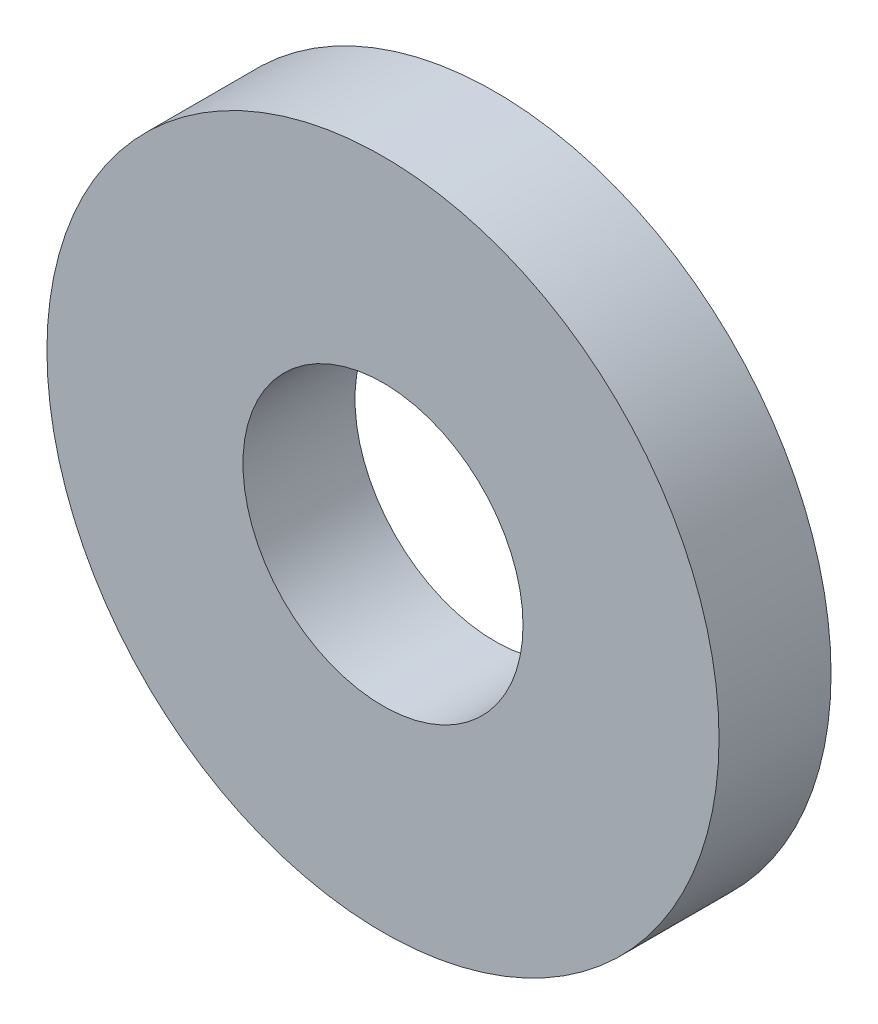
from build123d import *

# Parameters (mm, degrees)
ANILLO_PROFILE_R  = 12
TALADRO_PROFILE_R = 5


with BuildPart() as part:
    # Anillo: sweep along a curve in space
    with BuildLine() as anillo_path:
        Line((-425.1, 65, -54), (-425.1, 65, -50))
    # Anillo profile (on start of the path) → Anillo (sweep)
    with BuildSketch(Plane(origin=(-425.1, 65, -54), x_dir=(1, 0, 0), z_dir=(0, 0, 1))):
        Circle(ANILLO_PROFILE_R)
    sweep(path=anillo_path.line)

    # Taladro: sweep along a curve in space
    with BuildLine() as taladro_path:
        Line((-425.1, 65, -54), (-425.1, 65, -50))
    # Taladro profile (on start of the path) → Taladro (sweep, cut)
    with BuildSketch(Plane(origin=(-425.1, 65, -54), x_dir=(1, 0, 0), z_dir=(0, 0, 1))):
        Circle(TALADRO_PROFILE_R)
    sweep(path=taladro_path.line, mode=Mode.SUBTRACT)


solid = part.part
